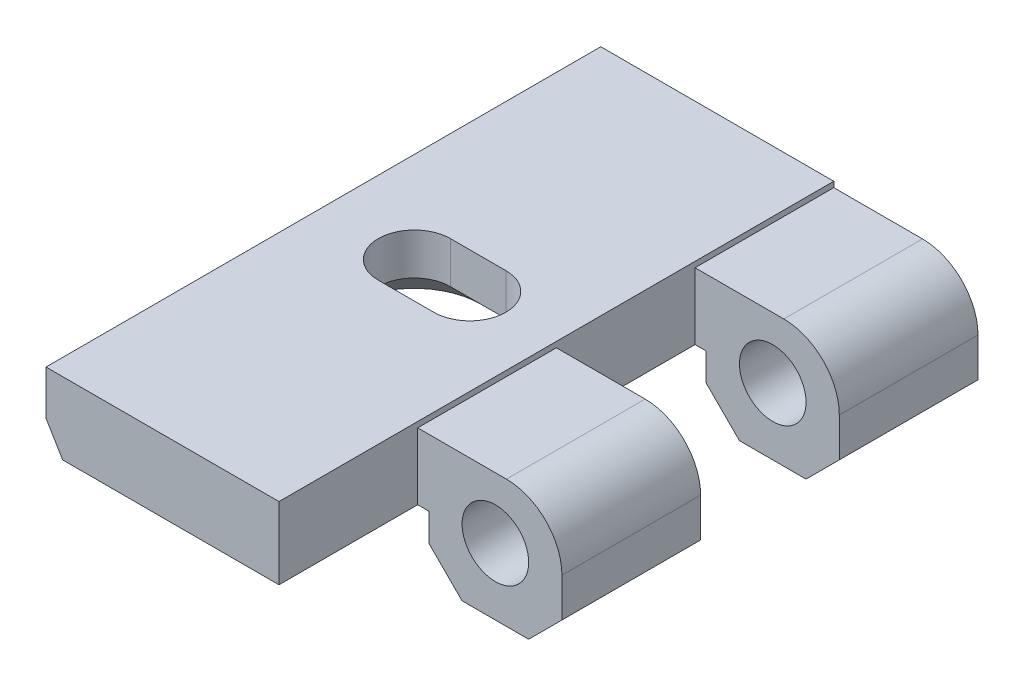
ISO-10303-21;
HEADER;
FILE_DESCRIPTION(('STEP AP214'),'2;1');
FILE_NAME('part.step','',(''),(''),'','','');
FILE_SCHEMA(('AUTOMOTIVE_DESIGN { 1 0 10303 214 1 1 1 1 }'));
ENDSEC;
DATA;
#1=APPLICATION_CONTEXT('core data for automotive mechanical design processes');
#2=APPLICATION_PROTOCOL_DEFINITION('international standard','automotive_design',2000,#1);
#3=PRODUCT_CONTEXT('',#1,'mechanical');
#4=PRODUCT('Part','Part','',(#3));
#5=PRODUCT_RELATED_PRODUCT_CATEGORY('part','',(#4));
#6=PRODUCT_DEFINITION_FORMATION('','',#4);
#7=PRODUCT_DEFINITION_CONTEXT('part definition',#1,'design');
#8=PRODUCT_DEFINITION('design','',#6,#7);
#9=PRODUCT_DEFINITION_SHAPE('','',#8);
#10=(LENGTH_UNIT() NAMED_UNIT(*) SI_UNIT(.MILLI.,.METRE.));
#11=(NAMED_UNIT(*) PLANE_ANGLE_UNIT() SI_UNIT($,.RADIAN.));
#12=(NAMED_UNIT(*) SI_UNIT($,.STERADIAN.) SOLID_ANGLE_UNIT());
#13=UNCERTAINTY_MEASURE_WITH_UNIT(LENGTH_MEASURE(1.E-05),#10,'distance_accuracy_value','');
#14=(GEOMETRIC_REPRESENTATION_CONTEXT(3) GLOBAL_UNCERTAINTY_ASSIGNED_CONTEXT((#13)) GLOBAL_UNIT_ASSIGNED_CONTEXT((#10,
#11,#12)) REPRESENTATION_CONTEXT('',''));
#15=CARTESIAN_POINT('',(0.,0.,0.));
#16=DIRECTION('',(0.,0.,1.));
#17=DIRECTION('',(1.,0.,0.));
#18=AXIS2_PLACEMENT_3D('',#15,#16,#17);
#19=CARTESIAN_POINT('',(-20.3,32.8500765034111,0.));
#20=DIRECTION('',(-0.707106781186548,-0.707106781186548,0.));
#21=DIRECTION('',(0.707106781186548,-0.707106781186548,0.));
#22=AXIS2_PLACEMENT_3D('',#19,#20,#21);
#23=PLANE('',#22);
#24=DIRECTION('',(0.707106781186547,-0.707106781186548,0.));
#25=VECTOR('',#24,1.);
#26=CARTESIAN_POINT('',(-23.3,35.8500765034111,0.));
#27=LINE('',#26,#25);
#28=CARTESIAN_POINT('',(-23.3,35.8500765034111,0.));
#29=VERTEX_POINT('',#28);
#30=CARTESIAN_POINT('',(-20.3,32.8500765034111,0.));
#31=VERTEX_POINT('',#30);
#32=EDGE_CURVE('E143',#29,#31,#27,.T.);
#33=ORIENTED_EDGE('',*,*,#32,.T.);
#34=DIRECTION('',(0.,0.,-1.));
#35=VECTOR('',#34,1.);
#36=CARTESIAN_POINT('',(-20.3,32.8500765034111,0.));
#37=LINE('',#36,#35);
#38=CARTESIAN_POINT('',(-20.3,32.8500765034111,12.5));
#39=VERTEX_POINT('',#38);
#40=EDGE_CURVE('E130',#39,#31,#37,.T.);
#41=ORIENTED_EDGE('',*,*,#40,.F.);
#42=DIRECTION('',(0.707106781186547,-0.707106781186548,0.));
#43=VECTOR('',#42,1.);
#44=CARTESIAN_POINT('',(-23.3,35.8500765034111,12.5));
#45=LINE('',#44,#43);
#46=CARTESIAN_POINT('',(-23.3,35.8500765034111,12.5));
#47=VERTEX_POINT('',#46);
#48=EDGE_CURVE('E145',#47,#39,#45,.T.);
#49=ORIENTED_EDGE('',*,*,#48,.F.);
#50=DIRECTION('',(0.,0.,1.));
#51=VECTOR('',#50,1.);
#52=CARTESIAN_POINT('',(-23.3,35.8500765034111,0.));
#53=LINE('',#52,#51);
#54=EDGE_CURVE('E138',#29,#47,#53,.T.);
#55=ORIENTED_EDGE('',*,*,#54,.F.);
#56=EDGE_LOOP('',(#33,#41,#49,#55));
#57=FACE_BOUND('',#56,.T.);
#58=ADVANCED_FACE('F16',(#57),#23,.T.);
#59=CARTESIAN_POINT('',(-14.3,32.8500765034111,0.));
#60=DIRECTION('',(0.,-1.,0.));
#61=DIRECTION('',(0.,0.,-1.));
#62=AXIS2_PLACEMENT_3D('',#59,#60,#61);
#63=PLANE('',#62);
#64=DIRECTION('',(1.,0.,0.));
#65=VECTOR('',#64,1.);
#66=CARTESIAN_POINT('',(-18.0886728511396,32.8500765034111,0.));
#67=LINE('',#66,#65);
#68=CARTESIAN_POINT('',(-14.3,32.8500765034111,0.));
#69=VERTEX_POINT('',#68);
#70=EDGE_CURVE('E164',#31,#69,#67,.T.);
#71=ORIENTED_EDGE('',*,*,#70,.T.);
#72=DIRECTION('',(0.,0.,1.));
#73=VECTOR('',#72,1.);
#74=CARTESIAN_POINT('',(-14.3,32.8500765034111,0.));
#75=LINE('',#74,#73);
#76=CARTESIAN_POINT('',(-14.3,32.8500765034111,12.5));
#77=VERTEX_POINT('',#76);
#78=EDGE_CURVE('E444',#77,#69,#75,.F.);
#79=ORIENTED_EDGE('',*,*,#78,.F.);
#80=DIRECTION('',(1.,0.,0.));
#81=VECTOR('',#80,1.);
#82=CARTESIAN_POINT('',(-18.0886728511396,32.8500765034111,12.5));
#83=LINE('',#82,#81);
#84=EDGE_CURVE('E174',#39,#77,#83,.T.);
#85=ORIENTED_EDGE('',*,*,#84,.F.);
#86=ORIENTED_EDGE('',*,*,#40,.T.);
#87=EDGE_LOOP('',(#71,#79,#85,#86));
#88=FACE_BOUND('',#87,.T.);
#89=ADVANCED_FACE('F448',(#88),#63,.T.);
#90=CARTESIAN_POINT('',(-11.3,35.8500765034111,0.));
#91=DIRECTION('',(0.707106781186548,-0.707106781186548,0.));
#92=DIRECTION('',(0.707106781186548,0.707106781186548,0.));
#93=AXIS2_PLACEMENT_3D('',#90,#91,#92);
#94=PLANE('',#93);
#95=DIRECTION('',(0.707106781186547,0.707106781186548,0.));
#96=VECTOR('',#95,1.);
#97=CARTESIAN_POINT('',(-14.3,32.8500765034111,0.));
#98=LINE('',#97,#96);
#99=CARTESIAN_POINT('',(-11.3,35.8500765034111,0.));
#100=VERTEX_POINT('',#99);
#101=EDGE_CURVE('E166',#69,#100,#98,.T.);
#102=ORIENTED_EDGE('',*,*,#101,.T.);
#103=DIRECTION('',(0.,0.,-1.));
#104=VECTOR('',#103,1.);
#105=CARTESIAN_POINT('',(-11.3,35.8500765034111,0.));
#106=LINE('',#105,#104);
#107=CARTESIAN_POINT('',(-11.3,35.8500765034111,12.5));
#108=VERTEX_POINT('',#107);
#109=EDGE_CURVE('E113',#108,#100,#106,.T.);
#110=ORIENTED_EDGE('',*,*,#109,.F.);
#111=DIRECTION('',(0.707106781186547,0.707106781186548,0.));
#112=VECTOR('',#111,1.);
#113=CARTESIAN_POINT('',(-14.3,32.8500765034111,12.5));
#114=LINE('',#113,#112);
#115=EDGE_CURVE('E170',#77,#108,#114,.T.);
#116=ORIENTED_EDGE('',*,*,#115,.F.);
#117=ORIENTED_EDGE('',*,*,#78,.T.);
#118=EDGE_LOOP('',(#102,#110,#116,#117));
#119=FACE_BOUND('',#118,.T.);
#120=ADVANCED_FACE('F538',(#119),#94,.T.);
#121=CARTESIAN_POINT('',(-11.3,39.3500765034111,0.));
#122=DIRECTION('',(1.,0.,0.));
#123=DIRECTION('',(0.,0.,-1.));
#124=AXIS2_PLACEMENT_3D('',#121,#122,#123);
#125=PLANE('',#124);
#126=DIRECTION('',(0.,1.,0.));
#127=VECTOR('',#126,1.);
#128=CARTESIAN_POINT('',(-11.3,38.9414196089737,0.));
#129=LINE('',#128,#127);
#130=CARTESIAN_POINT('',(-11.3,39.3500765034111,0.));
#131=VERTEX_POINT('',#130);
#132=EDGE_CURVE('E402',#100,#131,#129,.T.);
#133=ORIENTED_EDGE('',*,*,#132,.T.);
#134=DIRECTION('',(0.,0.,1.));
#135=VECTOR('',#134,1.);
#136=CARTESIAN_POINT('',(-11.3,39.3500765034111,0.));
#137=LINE('',#136,#135);
#138=CARTESIAN_POINT('',(-11.3,39.3500765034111,12.5));
#139=VERTEX_POINT('',#138);
#140=EDGE_CURVE('E102',#139,#131,#137,.F.);
#141=ORIENTED_EDGE('',*,*,#140,.F.);
#142=DIRECTION('',(0.,1.,0.));
#143=VECTOR('',#142,1.);
#144=CARTESIAN_POINT('',(-11.3,38.9414196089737,12.5));
#145=LINE('',#144,#143);
#146=EDGE_CURVE('E173',#108,#139,#145,.T.);
#147=ORIENTED_EDGE('',*,*,#146,.F.);
#148=ORIENTED_EDGE('',*,*,#109,.T.);
#149=EDGE_LOOP('',(#133,#141,#147,#148));
#150=FACE_BOUND('',#149,.T.);
#151=ADVANCED_FACE('F537',(#150),#125,.T.);
#152=CARTESIAN_POINT('',(-16.3,39.3500765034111,0.));
#153=DIRECTION('',(0.,0.,1.));
#154=DIRECTION('',(1.,0.,0.));
#155=AXIS2_PLACEMENT_3D('',#152,#153,#154);
#156=CYLINDRICAL_SURFACE('',#155,5.);
#157=CARTESIAN_POINT('',(-16.3,39.3500765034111,0.));
#158=DIRECTION('',(0.,0.,1.));
#159=DIRECTION('',(1.,0.,0.));
#160=AXIS2_PLACEMENT_3D('',#157,#158,#159);
#161=CIRCLE('',#160,5.);
#162=CARTESIAN_POINT('',(-16.3,44.3500765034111,0.));
#163=VERTEX_POINT('',#162);
#164=EDGE_CURVE('E401',#131,#163,#161,.T.);
#165=ORIENTED_EDGE('',*,*,#164,.T.);
#166=DIRECTION('',(0.,0.,1.));
#167=VECTOR('',#166,1.);
#168=CARTESIAN_POINT('',(-16.3,44.3500765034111,0.));
#169=LINE('',#168,#167);
#170=CARTESIAN_POINT('',(-16.3,44.3500765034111,12.5));
#171=VERTEX_POINT('',#170);
#172=EDGE_CURVE('E158',#171,#163,#169,.F.);
#173=ORIENTED_EDGE('',*,*,#172,.F.);
#174=CARTESIAN_POINT('',(-16.3,39.3500765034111,12.5));
#175=DIRECTION('',(0.,0.,1.));
#176=DIRECTION('',(1.,0.,0.));
#177=AXIS2_PLACEMENT_3D('',#174,#175,#176);
#178=CIRCLE('',#177,5.);
#179=EDGE_CURVE('E19',#139,#171,#178,.T.);
#180=ORIENTED_EDGE('',*,*,#179,.F.);
#181=ORIENTED_EDGE('',*,*,#140,.T.);
#182=EDGE_LOOP('',(#165,#173,#180,#181));
#183=FACE_BOUND('',#182,.T.);
#184=ADVANCED_FACE('F529',(#183),#156,.T.);
#185=CARTESIAN_POINT('',(-17.3,38.8500765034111,0.));
#186=DIRECTION('',(0.,0.,1.));
#187=DIRECTION('',(1.,0.,0.));
#188=AXIS2_PLACEMENT_3D('',#185,#186,#187);
#189=CYLINDRICAL_SURFACE('',#188,3.);
#190=CARTESIAN_POINT('',(-17.3,38.8500765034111,0.));
#191=DIRECTION('',(0.,0.,1.));
#192=DIRECTION('',(1.,0.,0.));
#193=AXIS2_PLACEMENT_3D('',#190,#191,#192);
#194=CIRCLE('',#193,3.);
#195=CARTESIAN_POINT('',(-14.3,38.8500765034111,0.));
#196=VERTEX_POINT('',#195);
#197=EDGE_CURVE('E393',#196,#196,#194,.F.);
#198=ORIENTED_EDGE('',*,*,#197,.T.);
#199=EDGE_LOOP('',(#198));
#200=FACE_BOUND('',#199,.T.);
#201=CARTESIAN_POINT('',(-17.3,38.8500765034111,12.5));
#202=DIRECTION('',(0.,0.,1.));
#203=DIRECTION('',(1.,0.,0.));
#204=AXIS2_PLACEMENT_3D('',#201,#202,#203);
#205=CIRCLE('',#204,3.);
#206=CARTESIAN_POINT('',(-14.3,38.8500765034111,12.5));
#207=VERTEX_POINT('',#206);
#208=EDGE_CURVE('E410',#207,#207,#205,.F.);
#209=ORIENTED_EDGE('',*,*,#208,.F.);
#210=EDGE_LOOP('',(#209));
#211=FACE_BOUND('',#210,.T.);
#212=ADVANCED_FACE('F549',(#200,#211),#189,.F.);
#213=CARTESIAN_POINT('',(-23.3,35.8500765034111,0.));
#214=DIRECTION('',(-1.,0.,0.));
#215=DIRECTION('',(0.,0.,1.));
#216=AXIS2_PLACEMENT_3D('',#213,#214,#215);
#217=PLANE('',#216);
#218=DIRECTION('',(0.,1.,0.));
#219=VECTOR('',#218,1.);
#220=CARTESIAN_POINT('',(-23.3,38.9414196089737,0.));
#221=LINE('',#220,#219);
#222=CARTESIAN_POINT('',(-23.3,38.3500765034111,0.));
#223=VERTEX_POINT('',#222);
#224=EDGE_CURVE('E151',#223,#29,#221,.F.);
#225=ORIENTED_EDGE('',*,*,#224,.T.);
#226=ORIENTED_EDGE('',*,*,#54,.T.);
#227=DIRECTION('',(0.,1.,0.));
#228=VECTOR('',#227,1.);
#229=CARTESIAN_POINT('',(-23.3,38.9414196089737,12.5));
#230=LINE('',#229,#228);
#231=CARTESIAN_POINT('',(-23.3,38.3500765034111,12.5));
#232=VERTEX_POINT('',#231);
#233=EDGE_CURVE('E147',#232,#47,#230,.F.);
#234=ORIENTED_EDGE('',*,*,#233,.F.);
#235=DIRECTION('',(0.,0.,-1.));
#236=VECTOR('',#235,1.);
#237=CARTESIAN_POINT('',(-23.3,38.3500765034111,-25.));
#238=LINE('',#237,#236);
#239=EDGE_CURVE('E154',#223,#232,#238,.F.);
#240=ORIENTED_EDGE('',*,*,#239,.F.);
#241=EDGE_LOOP('',(#225,#226,#234,#240));
#242=FACE_BOUND('',#241,.T.);
#243=ADVANCED_FACE('F152',(#242),#217,.T.);
#244=CARTESIAN_POINT('',(-18.0886728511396,38.9414196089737,12.5));
#245=DIRECTION('',(0.,0.,1.));
#246=DIRECTION('',(1.,0.,0.));
#247=AXIS2_PLACEMENT_3D('',#244,#245,#246);
#248=PLANE('',#247);
#249=ORIENTED_EDGE('',*,*,#208,.T.);
#250=EDGE_LOOP('',(#249));
#251=FACE_BOUND('',#250,.T.);
#252=ORIENTED_EDGE('',*,*,#146,.T.);
#253=ORIENTED_EDGE('',*,*,#179,.T.);
#254=DIRECTION('',(1.,0.,0.));
#255=VECTOR('',#254,1.);
#256=CARTESIAN_POINT('',(-17.3,44.3500765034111,12.5));
#257=LINE('',#256,#255);
#258=CARTESIAN_POINT('',(-24.3,44.3500765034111,12.5));
#259=VERTEX_POINT('',#258);
#260=EDGE_CURVE('E407',#259,#171,#257,.T.);
#261=ORIENTED_EDGE('',*,*,#260,.F.);
#262=DIRECTION('',(0.,1.,0.));
#263=VECTOR('',#262,1.);
#264=CARTESIAN_POINT('',(-24.3,44.8500765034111,12.5));
#265=LINE('',#264,#263);
#266=CARTESIAN_POINT('',(-24.3,38.3500765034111,12.5));
#267=VERTEX_POINT('',#266);
#268=EDGE_CURVE('E406',#267,#259,#265,.T.);
#269=ORIENTED_EDGE('',*,*,#268,.F.);
#270=DIRECTION('',(1.,0.,0.));
#271=VECTOR('',#270,1.);
#272=CARTESIAN_POINT('',(-24.3,38.3500765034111,12.5));
#273=LINE('',#272,#271);
#274=EDGE_CURVE('E416',#232,#267,#273,.F.);
#275=ORIENTED_EDGE('',*,*,#274,.F.);
#276=ORIENTED_EDGE('',*,*,#233,.T.);
#277=ORIENTED_EDGE('',*,*,#48,.T.);
#278=ORIENTED_EDGE('',*,*,#84,.T.);
#279=ORIENTED_EDGE('',*,*,#115,.T.);
#280=EDGE_LOOP('',(#252,#253,#261,#269,#275,#276,#277,#278,#279));
#281=FACE_BOUND('',#280,.T.);
#282=ADVANCED_FACE('F450',(#251,#281),#248,.T.);
#283=CARTESIAN_POINT('',(-17.3,44.3500765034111,0.));
#284=DIRECTION('',(0.,1.,0.));
#285=DIRECTION('',(0.,0.,1.));
#286=AXIS2_PLACEMENT_3D('',#283,#284,#285);
#287=PLANE('',#286);
#288=DIRECTION('',(1.,0.,0.));
#289=VECTOR('',#288,1.);
#290=CARTESIAN_POINT('',(-18.0886728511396,44.3500765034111,0.));
#291=LINE('',#290,#289);
#292=CARTESIAN_POINT('',(-24.3,44.3500765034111,0.));
#293=VERTEX_POINT('',#292);
#294=EDGE_CURVE('E398',#163,#293,#291,.F.);
#295=ORIENTED_EDGE('',*,*,#294,.T.);
#296=DIRECTION('',(0.,0.,-1.));
#297=VECTOR('',#296,1.);
#298=CARTESIAN_POINT('',(-24.3,44.3500765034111,-25.));
#299=LINE('',#298,#297);
#300=EDGE_CURVE('E397',#259,#293,#299,.T.);
#301=ORIENTED_EDGE('',*,*,#300,.F.);
#302=ORIENTED_EDGE('',*,*,#260,.T.);
#303=ORIENTED_EDGE('',*,*,#172,.T.);
#304=EDGE_LOOP('',(#295,#301,#302,#303));
#305=FACE_BOUND('',#304,.T.);
#306=ADVANCED_FACE('F526',(#305),#287,.T.);
#307=CARTESIAN_POINT('',(-18.0886728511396,38.9414196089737,0.));
#308=DIRECTION('',(0.,0.,1.));
#309=DIRECTION('',(1.,0.,0.));
#310=AXIS2_PLACEMENT_3D('',#307,#308,#309);
#311=PLANE('',#310);
#312=ORIENTED_EDGE('',*,*,#197,.F.);
#313=EDGE_LOOP('',(#312));
#314=FACE_BOUND('',#313,.T.);
#315=ORIENTED_EDGE('',*,*,#164,.F.);
#316=ORIENTED_EDGE('',*,*,#132,.F.);
#317=ORIENTED_EDGE('',*,*,#101,.F.);
#318=ORIENTED_EDGE('',*,*,#70,.F.);
#319=ORIENTED_EDGE('',*,*,#32,.F.);
#320=ORIENTED_EDGE('',*,*,#224,.F.);
#321=DIRECTION('',(1.,0.,0.));
#322=VECTOR('',#321,1.);
#323=CARTESIAN_POINT('',(-24.3,38.3500765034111,0.));
#324=LINE('',#323,#322);
#325=CARTESIAN_POINT('',(-24.3,38.3500765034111,0.));
#326=VERTEX_POINT('',#325);
#327=EDGE_CURVE('E392',#326,#223,#324,.T.);
#328=ORIENTED_EDGE('',*,*,#327,.F.);
#329=DIRECTION('',(0.,1.,0.));
#330=VECTOR('',#329,1.);
#331=CARTESIAN_POINT('',(-24.3,44.8500765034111,0.));
#332=LINE('',#331,#330);
#333=EDGE_CURVE('E388',#293,#326,#332,.F.);
#334=ORIENTED_EDGE('',*,*,#333,.F.);
#335=ORIENTED_EDGE('',*,*,#294,.F.);
#336=EDGE_LOOP('',(#315,#316,#317,#318,#319,#320,#328,#334,#335));
#337=FACE_BOUND('',#336,.T.);
#338=ADVANCED_FACE('F162',(#314,#337),#311,.F.);
#339=CARTESIAN_POINT('',(-18.0886728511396,38.9414196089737,-12.5));
#340=DIRECTION('',(0.,0.,1.));
#341=DIRECTION('',(1.,0.,0.));
#342=AXIS2_PLACEMENT_3D('',#339,#340,#341);
#343=PLANE('',#342);
#344=CARTESIAN_POINT('',(-17.3,38.8500765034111,-12.5));
#345=DIRECTION('',(0.,0.,1.));
#346=DIRECTION('',(1.,0.,0.));
#347=AXIS2_PLACEMENT_3D('',#344,#345,#346);
#348=CIRCLE('',#347,3.);
#349=CARTESIAN_POINT('',(-14.3,38.8500765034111,-12.5));
#350=VERTEX_POINT('',#349);
#351=EDGE_CURVE('E325',#350,#350,#348,.F.);
#352=ORIENTED_EDGE('',*,*,#351,.T.);
#353=EDGE_LOOP('',(#352));
#354=FACE_BOUND('',#353,.T.);
#355=DIRECTION('',(0.,1.,0.));
#356=VECTOR('',#355,1.);
#357=CARTESIAN_POINT('',(-11.3,39.3500765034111,-12.5));
#358=LINE('',#357,#356);
#359=CARTESIAN_POINT('',(-11.3,39.3500765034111,-12.5));
#360=VERTEX_POINT('',#359);
#361=CARTESIAN_POINT('',(-11.3,35.8500765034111,-12.5));
#362=VERTEX_POINT('',#361);
#363=EDGE_CURVE('E339',#360,#362,#358,.F.);
#364=ORIENTED_EDGE('',*,*,#363,.F.);
#365=CARTESIAN_POINT('',(-16.3,39.3500765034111,-12.5));
#366=DIRECTION('',(0.,0.,1.));
#367=DIRECTION('',(1.,0.,0.));
#368=AXIS2_PLACEMENT_3D('',#365,#366,#367);
#369=CIRCLE('',#368,5.);
#370=CARTESIAN_POINT('',(-16.3,44.3500765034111,-12.5));
#371=VERTEX_POINT('',#370);
#372=EDGE_CURVE('E335',#371,#360,#369,.F.);
#373=ORIENTED_EDGE('',*,*,#372,.F.);
#374=DIRECTION('',(1.,0.,0.));
#375=VECTOR('',#374,1.);
#376=CARTESIAN_POINT('',(-17.3,44.3500765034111,-12.5));
#377=LINE('',#376,#375);
#378=CARTESIAN_POINT('',(-24.3,44.3500765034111,-12.5));
#379=VERTEX_POINT('',#378);
#380=EDGE_CURVE('E326',#379,#371,#377,.T.);
#381=ORIENTED_EDGE('',*,*,#380,.F.);
#382=DIRECTION('',(0.,1.,0.));
#383=VECTOR('',#382,1.);
#384=CARTESIAN_POINT('',(-24.3,44.8500765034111,-12.5));
#385=LINE('',#384,#383);
#386=CARTESIAN_POINT('',(-24.3,38.3500765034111,-12.5));
#387=VERTEX_POINT('',#386);
#388=EDGE_CURVE('E329',#387,#379,#385,.T.);
#389=ORIENTED_EDGE('',*,*,#388,.F.);
#390=DIRECTION('',(1.,0.,0.));
#391=VECTOR('',#390,1.);
#392=CARTESIAN_POINT('',(-24.3,38.3500765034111,-12.5));
#393=LINE('',#392,#391);
#394=CARTESIAN_POINT('',(-23.3,38.3500765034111,-12.5));
#395=VERTEX_POINT('',#394);
#396=EDGE_CURVE('E389',#395,#387,#393,.F.);
#397=ORIENTED_EDGE('',*,*,#396,.F.);
#398=DIRECTION('',(0.,1.,0.));
#399=VECTOR('',#398,1.);
#400=CARTESIAN_POINT('',(-23.3,35.8500765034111,-12.5));
#401=LINE('',#400,#399);
#402=CARTESIAN_POINT('',(-23.3,35.8500765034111,-12.5));
#403=VERTEX_POINT('',#402);
#404=EDGE_CURVE('E367',#403,#395,#401,.T.);
#405=ORIENTED_EDGE('',*,*,#404,.F.);
#406=DIRECTION('',(0.707106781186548,-0.707106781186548,0.));
#407=VECTOR('',#406,1.);
#408=CARTESIAN_POINT('',(-20.3,32.8500765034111,-12.5));
#409=LINE('',#408,#407);
#410=CARTESIAN_POINT('',(-20.3,32.8500765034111,-12.5));
#411=VERTEX_POINT('',#410);
#412=EDGE_CURVE('E360',#411,#403,#409,.F.);
#413=ORIENTED_EDGE('',*,*,#412,.F.);
#414=DIRECTION('',(1.,0.,0.));
#415=VECTOR('',#414,1.);
#416=CARTESIAN_POINT('',(-14.3,32.8500765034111,-12.5));
#417=LINE('',#416,#415);
#418=CARTESIAN_POINT('',(-14.3,32.8500765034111,-12.5));
#419=VERTEX_POINT('',#418);
#420=EDGE_CURVE('E353',#419,#411,#417,.F.);
#421=ORIENTED_EDGE('',*,*,#420,.F.);
#422=DIRECTION('',(0.707106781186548,0.707106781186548,0.));
#423=VECTOR('',#422,1.);
#424=CARTESIAN_POINT('',(-11.3,35.8500765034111,-12.5));
#425=LINE('',#424,#423);
#426=EDGE_CURVE('E346',#362,#419,#425,.F.);
#427=ORIENTED_EDGE('',*,*,#426,.F.);
#428=EDGE_LOOP('',(#364,#373,#381,#389,#397,#405,#413,#421,#427));
#429=FACE_BOUND('',#428,.T.);
#430=ADVANCED_FACE('F521',(#354,#429),#343,.T.);
#431=CARTESIAN_POINT('',(-24.3,38.3500765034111,-25.));
#432=DIRECTION('',(0.,-1.,0.));
#433=DIRECTION('',(0.,0.,-1.));
#434=AXIS2_PLACEMENT_3D('',#431,#432,#433);
#435=PLANE('',#434);
#436=DIRECTION('',(1.,0.,0.));
#437=VECTOR('',#436,1.);
#438=CARTESIAN_POINT('',(-34.6,38.3500765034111,6.));
#439=LINE('',#438,#437);
#440=CARTESIAN_POINT('',(-32.1,38.3500765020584,6.00000000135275));
#441=VERTEX_POINT('',#440);
#442=CARTESIAN_POINT('',(-37.1,38.3500765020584,6.00000000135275));
#443=VERTEX_POINT('',#442);
#444=EDGE_CURVE('E306',#441,#443,#439,.F.);
#445=ORIENTED_EDGE('',*,*,#444,.F.);
#446=CARTESIAN_POINT('',(-32.1,38.3500765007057,0.));
#447=DIRECTION('',(0.,-1.,0.));
#448=DIRECTION('',(0.,0.,-1.));
#449=AXIS2_PLACEMENT_3D('',#446,#447,#448);
#450=CIRCLE('',#449,5.999999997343);
#451=CARTESIAN_POINT('',(-32.1,38.3500765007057,-5.99999999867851));
#452=VERTEX_POINT('',#451);
#453=EDGE_CURVE('E314',#441,#452,#450,.F.);
#454=ORIENTED_EDGE('',*,*,#453,.T.);
#455=DIRECTION('',(1.,0.,0.));
#456=VECTOR('',#455,1.);
#457=CARTESIAN_POINT('',(-34.6,38.3500765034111,-6.));
#458=LINE('',#457,#456);
#459=CARTESIAN_POINT('',(-37.1,38.3500765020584,-6.00000000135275));
#460=VERTEX_POINT('',#459);
#461=EDGE_CURVE('E320',#460,#452,#458,.T.);
#462=ORIENTED_EDGE('',*,*,#461,.F.);
#463=CARTESIAN_POINT('',(-37.1,38.3500765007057,0.));
#464=DIRECTION('',(0.,-1.,0.));
#465=DIRECTION('',(0.,0.,-1.));
#466=AXIS2_PLACEMENT_3D('',#463,#464,#465);
#467=CIRCLE('',#466,5.99999999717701);
#468=EDGE_CURVE('E321',#460,#443,#467,.F.);
#469=ORIENTED_EDGE('',*,*,#468,.T.);
#470=EDGE_LOOP('',(#445,#454,#462,#469));
#471=FACE_BOUND('',#470,.T.);
#472=ORIENTED_EDGE('',*,*,#274,.T.);
#473=DIRECTION('',(0.,0.,-1.));
#474=VECTOR('',#473,1.);
#475=CARTESIAN_POINT('',(-24.3,38.3500765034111,-25.));
#476=LINE('',#475,#474);
#477=CARTESIAN_POINT('',(-24.3,38.3500765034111,25.));
#478=VERTEX_POINT('',#477);
#479=EDGE_CURVE('E300',#478,#267,#476,.T.);
#480=ORIENTED_EDGE('',*,*,#479,.F.);
#481=DIRECTION('',(1.,0.,0.));
#482=VECTOR('',#481,1.);
#483=CARTESIAN_POINT('',(-34.5690995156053,38.3500765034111,25.));
#484=LINE('',#483,#482);
#485=CARTESIAN_POINT('',(-43.8,38.3500765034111,25.));
#486=VERTEX_POINT('',#485);
#487=EDGE_CURVE('E413',#486,#478,#484,.T.);
#488=ORIENTED_EDGE('',*,*,#487,.F.);
#489=DIRECTION('',(0.,0.,1.));
#490=VECTOR('',#489,1.);
#491=CARTESIAN_POINT('',(-43.8,38.3500765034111,-25.));
#492=LINE('',#491,#490);
#493=CARTESIAN_POINT('',(-43.8,38.3500765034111,-25.));
#494=VERTEX_POINT('',#493);
#495=EDGE_CURVE('E373',#494,#486,#492,.T.);
#496=ORIENTED_EDGE('',*,*,#495,.F.);
#497=DIRECTION('',(1.,0.,0.));
#498=VECTOR('',#497,1.);
#499=CARTESIAN_POINT('',(-34.5690995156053,38.3500765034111,-25.));
#500=LINE('',#499,#498);
#501=CARTESIAN_POINT('',(-23.3,38.3500765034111,-25.));
#502=VERTEX_POINT('',#501);
#503=EDGE_CURVE('E363',#494,#502,#500,.T.);
#504=ORIENTED_EDGE('',*,*,#503,.T.);
#505=DIRECTION('',(0.,0.,1.));
#506=VECTOR('',#505,1.);
#507=CARTESIAN_POINT('',(-23.3,38.3500765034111,-25.));
#508=LINE('',#507,#506);
#509=EDGE_CURVE('E364',#395,#502,#508,.F.);
#510=ORIENTED_EDGE('',*,*,#509,.F.);
#511=ORIENTED_EDGE('',*,*,#396,.T.);
#512=DIRECTION('',(0.,0.,-1.));
#513=VECTOR('',#512,1.);
#514=CARTESIAN_POINT('',(-24.3,38.3500765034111,-25.));
#515=LINE('',#514,#513);
#516=EDGE_CURVE('E385',#326,#387,#515,.T.);
#517=ORIENTED_EDGE('',*,*,#516,.F.);
#518=ORIENTED_EDGE('',*,*,#327,.T.);
#519=ORIENTED_EDGE('',*,*,#239,.T.);
#520=EDGE_LOOP('',(#472,#480,#488,#496,#504,#510,#511,#517,#518,#519));
#521=FACE_BOUND('',#520,.T.);
#522=ADVANCED_FACE('F504',(#471,#521),#435,.T.);
#523=CARTESIAN_POINT('',(-23.3,35.8500765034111,-25.));
#524=DIRECTION('',(-1.,0.,0.));
#525=DIRECTION('',(0.,0.,1.));
#526=AXIS2_PLACEMENT_3D('',#523,#524,#525);
#527=PLANE('',#526);
#528=DIRECTION('',(0.,1.,0.));
#529=VECTOR('',#528,1.);
#530=CARTESIAN_POINT('',(-23.3,41.6750836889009,-25.));
#531=LINE('',#530,#529);
#532=CARTESIAN_POINT('',(-23.3,35.8500765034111,-25.));
#533=VERTEX_POINT('',#532);
#534=EDGE_CURVE('E356',#502,#533,#531,.F.);
#535=ORIENTED_EDGE('',*,*,#534,.T.);
#536=DIRECTION('',(0.,0.,1.));
#537=VECTOR('',#536,1.);
#538=CARTESIAN_POINT('',(-23.3,35.8500765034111,-25.));
#539=LINE('',#538,#537);
#540=EDGE_CURVE('E357',#403,#533,#539,.F.);
#541=ORIENTED_EDGE('',*,*,#540,.F.);
#542=ORIENTED_EDGE('',*,*,#404,.T.);
#543=ORIENTED_EDGE('',*,*,#509,.T.);
#544=EDGE_LOOP('',(#535,#541,#542,#543));
#545=FACE_BOUND('',#544,.T.);
#546=ADVANCED_FACE('F516',(#545),#527,.T.);
#547=CARTESIAN_POINT('',(-20.3,32.8500765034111,-25.));
#548=DIRECTION('',(-0.707106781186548,-0.707106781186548,0.));
#549=DIRECTION('',(0.707106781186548,-0.707106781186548,0.));
#550=AXIS2_PLACEMENT_3D('',#547,#548,#549);
#551=PLANE('',#550);
#552=DIRECTION('',(0.707106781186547,-0.707106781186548,0.));
#553=VECTOR('',#552,1.);
#554=CARTESIAN_POINT('',(-23.3,35.8500765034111,-25.));
#555=LINE('',#554,#553);
#556=CARTESIAN_POINT('',(-20.3,32.8500765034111,-25.));
#557=VERTEX_POINT('',#556);
#558=EDGE_CURVE('E349',#533,#557,#555,.T.);
#559=ORIENTED_EDGE('',*,*,#558,.T.);
#560=DIRECTION('',(0.,0.,-1.));
#561=VECTOR('',#560,1.);
#562=CARTESIAN_POINT('',(-20.3,32.8500765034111,-25.));
#563=LINE('',#562,#561);
#564=EDGE_CURVE('E350',#411,#557,#563,.T.);
#565=ORIENTED_EDGE('',*,*,#564,.F.);
#566=ORIENTED_EDGE('',*,*,#412,.T.);
#567=ORIENTED_EDGE('',*,*,#540,.T.);
#568=EDGE_LOOP('',(#559,#565,#566,#567));
#569=FACE_BOUND('',#568,.T.);
#570=ADVANCED_FACE('F518',(#569),#551,.T.);
#571=CARTESIAN_POINT('',(-14.3,32.8500765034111,-25.));
#572=DIRECTION('',(0.,-1.,0.));
#573=DIRECTION('',(0.,0.,-1.));
#574=AXIS2_PLACEMENT_3D('',#571,#572,#573);
#575=PLANE('',#574);
#576=DIRECTION('',(1.,0.,0.));
#577=VECTOR('',#576,1.);
#578=CARTESIAN_POINT('',(-34.5690995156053,32.8500765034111,-25.));
#579=LINE('',#578,#577);
#580=CARTESIAN_POINT('',(-14.3,32.8500765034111,-25.));
#581=VERTEX_POINT('',#580);
#582=EDGE_CURVE('E342',#557,#581,#579,.T.);
#583=ORIENTED_EDGE('',*,*,#582,.T.);
#584=DIRECTION('',(0.,0.,1.));
#585=VECTOR('',#584,1.);
#586=CARTESIAN_POINT('',(-14.3,32.8500765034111,-25.));
#587=LINE('',#586,#585);
#588=EDGE_CURVE('E343',#419,#581,#587,.F.);
#589=ORIENTED_EDGE('',*,*,#588,.F.);
#590=ORIENTED_EDGE('',*,*,#420,.T.);
#591=ORIENTED_EDGE('',*,*,#564,.T.);
#592=EDGE_LOOP('',(#583,#589,#590,#591));
#593=FACE_BOUND('',#592,.T.);
#594=ADVANCED_FACE('F572',(#593),#575,.T.);
#595=CARTESIAN_POINT('',(-11.3,35.8500765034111,-25.));
#596=DIRECTION('',(0.707106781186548,-0.707106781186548,0.));
#597=DIRECTION('',(0.707106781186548,0.707106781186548,0.));
#598=AXIS2_PLACEMENT_3D('',#595,#596,#597);
#599=PLANE('',#598);
#600=DIRECTION('',(0.707106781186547,0.707106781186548,0.));
#601=VECTOR('',#600,1.);
#602=CARTESIAN_POINT('',(-14.3,32.8500765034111,-25.));
#603=LINE('',#602,#601);
#604=CARTESIAN_POINT('',(-11.3,35.8500765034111,-25.));
#605=VERTEX_POINT('',#604);
#606=EDGE_CURVE('E296',#581,#605,#603,.T.);
#607=ORIENTED_EDGE('',*,*,#606,.T.);
#608=DIRECTION('',(0.,0.,-1.));
#609=VECTOR('',#608,1.);
#610=CARTESIAN_POINT('',(-11.3,35.8500765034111,-25.));
#611=LINE('',#610,#609);
#612=EDGE_CURVE('E336',#362,#605,#611,.T.);
#613=ORIENTED_EDGE('',*,*,#612,.F.);
#614=ORIENTED_EDGE('',*,*,#426,.T.);
#615=ORIENTED_EDGE('',*,*,#588,.T.);
#616=EDGE_LOOP('',(#607,#613,#614,#615));
#617=FACE_BOUND('',#616,.T.);
#618=ADVANCED_FACE('F575',(#617),#599,.T.);
#619=CARTESIAN_POINT('',(-11.3,39.3500765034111,-25.));
#620=DIRECTION('',(1.,0.,0.));
#621=DIRECTION('',(0.,0.,-1.));
#622=AXIS2_PLACEMENT_3D('',#619,#620,#621);
#623=PLANE('',#622);
#624=DIRECTION('',(0.,1.,0.));
#625=VECTOR('',#624,1.);
#626=CARTESIAN_POINT('',(-11.3,41.6750836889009,-25.));
#627=LINE('',#626,#625);
#628=CARTESIAN_POINT('',(-11.3,39.3500765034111,-25.));
#629=VERTEX_POINT('',#628);
#630=EDGE_CURVE('E294',#605,#629,#627,.T.);
#631=ORIENTED_EDGE('',*,*,#630,.T.);
#632=DIRECTION('',(0.,0.,1.));
#633=VECTOR('',#632,1.);
#634=CARTESIAN_POINT('',(-11.3,39.3500765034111,-25.));
#635=LINE('',#634,#633);
#636=EDGE_CURVE('E332',#360,#629,#635,.F.);
#637=ORIENTED_EDGE('',*,*,#636,.F.);
#638=ORIENTED_EDGE('',*,*,#363,.T.);
#639=ORIENTED_EDGE('',*,*,#612,.T.);
#640=EDGE_LOOP('',(#631,#637,#638,#639));
#641=FACE_BOUND('',#640,.T.);
#642=ADVANCED_FACE('F579',(#641),#623,.T.);
#643=CARTESIAN_POINT('',(-16.3,39.3500765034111,-25.));
#644=DIRECTION('',(0.,0.,1.));
#645=DIRECTION('',(1.,0.,0.));
#646=AXIS2_PLACEMENT_3D('',#643,#644,#645);
#647=CYLINDRICAL_SURFACE('',#646,5.);
#648=CARTESIAN_POINT('',(-16.3,39.3500765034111,-25.));
#649=DIRECTION('',(0.,0.,1.));
#650=DIRECTION('',(1.,0.,0.));
#651=AXIS2_PLACEMENT_3D('',#648,#649,#650);
#652=CIRCLE('',#651,5.);
#653=CARTESIAN_POINT('',(-16.3,44.3500765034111,-25.));
#654=VERTEX_POINT('',#653);
#655=EDGE_CURVE('E293',#629,#654,#652,.T.);
#656=ORIENTED_EDGE('',*,*,#655,.T.);
#657=DIRECTION('',(0.,0.,1.));
#658=VECTOR('',#657,1.);
#659=CARTESIAN_POINT('',(-16.3,44.3500765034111,-25.));
#660=LINE('',#659,#658);
#661=EDGE_CURVE('E322',#371,#654,#660,.F.);
#662=ORIENTED_EDGE('',*,*,#661,.F.);
#663=ORIENTED_EDGE('',*,*,#372,.T.);
#664=ORIENTED_EDGE('',*,*,#636,.T.);
#665=EDGE_LOOP('',(#656,#662,#663,#664));
#666=FACE_BOUND('',#665,.T.);
#667=ADVANCED_FACE('F583',(#666),#647,.T.);
#668=CARTESIAN_POINT('',(-17.3,44.3500765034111,-25.));
#669=DIRECTION('',(0.,1.,0.));
#670=DIRECTION('',(0.,0.,1.));
#671=AXIS2_PLACEMENT_3D('',#668,#669,#670);
#672=PLANE('',#671);
#673=DIRECTION('',(1.,0.,0.));
#674=VECTOR('',#673,1.);
#675=CARTESIAN_POINT('',(-34.5690995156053,44.3500765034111,-25.));
#676=LINE('',#675,#674);
#677=CARTESIAN_POINT('',(-24.3,44.3500765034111,-25.));
#678=VERTEX_POINT('',#677);
#679=EDGE_CURVE('E289',#654,#678,#676,.F.);
#680=ORIENTED_EDGE('',*,*,#679,.T.);
#681=DIRECTION('',(0.,0.,-1.));
#682=VECTOR('',#681,1.);
#683=CARTESIAN_POINT('',(-24.3,44.3500765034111,-25.));
#684=LINE('',#683,#682);
#685=EDGE_CURVE('E301',#379,#678,#684,.T.);
#686=ORIENTED_EDGE('',*,*,#685,.F.);
#687=ORIENTED_EDGE('',*,*,#380,.T.);
#688=ORIENTED_EDGE('',*,*,#661,.T.);
#689=EDGE_LOOP('',(#680,#686,#687,#688));
#690=FACE_BOUND('',#689,.T.);
#691=ADVANCED_FACE('F587',(#690),#672,.T.);
#692=CARTESIAN_POINT('',(-17.3,38.8500765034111,0.));
#693=DIRECTION('',(0.,0.,1.));
#694=DIRECTION('',(1.,0.,0.));
#695=AXIS2_PLACEMENT_3D('',#692,#693,#694);
#696=CYLINDRICAL_SURFACE('',#695,3.);
#697=ORIENTED_EDGE('',*,*,#351,.F.);
#698=EDGE_LOOP('',(#697));
#699=FACE_BOUND('',#698,.T.);
#700=CARTESIAN_POINT('',(-17.3,38.8500765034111,-25.));
#701=DIRECTION('',(0.,0.,1.));
#702=DIRECTION('',(1.,0.,0.));
#703=AXIS2_PLACEMENT_3D('',#700,#701,#702);
#704=CIRCLE('',#703,3.);
#705=CARTESIAN_POINT('',(-14.3,38.8500765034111,-25.));
#706=VERTEX_POINT('',#705);
#707=EDGE_CURVE('E288',#706,#706,#704,.F.);
#708=ORIENTED_EDGE('',*,*,#707,.T.);
#709=EDGE_LOOP('',(#708));
#710=FACE_BOUND('',#709,.T.);
#711=ADVANCED_FACE('F591',(#699,#710),#696,.F.);
#712=CARTESIAN_POINT('',(-43.8,38.3500765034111,-25.));
#713=DIRECTION('',(-0.857492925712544,-0.514495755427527,0.));
#714=DIRECTION('',(0.514495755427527,-0.857492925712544,0.));
#715=AXIS2_PLACEMENT_3D('',#712,#713,#714);
#716=PLANE('',#715);
#717=DIRECTION('',(0.514495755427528,-0.857492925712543,0.));
#718=VECTOR('',#717,1.);
#719=CARTESIAN_POINT('',(-45.3,40.8500765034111,-25.));
#720=LINE('',#719,#718);
#721=CARTESIAN_POINT('',(-45.3,40.8500765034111,-25.));
#722=VERTEX_POINT('',#721);
#723=EDGE_CURVE('E370',#722,#494,#720,.T.);
#724=ORIENTED_EDGE('',*,*,#723,.T.);
#725=ORIENTED_EDGE('',*,*,#495,.T.);
#726=DIRECTION('',(0.514495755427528,-0.857492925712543,0.));
#727=VECTOR('',#726,1.);
#728=CARTESIAN_POINT('',(-45.3,40.8500765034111,25.));
#729=LINE('',#728,#727);
#730=CARTESIAN_POINT('',(-45.3,40.8500765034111,25.));
#731=VERTEX_POINT('',#730);
#732=EDGE_CURVE('E305',#731,#486,#729,.T.);
#733=ORIENTED_EDGE('',*,*,#732,.F.);
#734=DIRECTION('',(0.,0.,1.));
#735=VECTOR('',#734,1.);
#736=CARTESIAN_POINT('',(-45.3,40.8500765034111,-25.));
#737=LINE('',#736,#735);
#738=EDGE_CURVE('E376',#722,#731,#737,.T.);
#739=ORIENTED_EDGE('',*,*,#738,.F.);
#740=EDGE_LOOP('',(#724,#725,#733,#739));
#741=FACE_BOUND('',#740,.T.);
#742=ADVANCED_FACE('F510',(#741),#716,.T.);
#743=CARTESIAN_POINT('',(-37.1,38.3500765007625,0.));
#744=DIRECTION('',(0.,-1.,0.));
#745=DIRECTION('',(0.,0.,-1.));
#746=AXIS2_PLACEMENT_3D('',#743,#744,#745);
#747=CONICAL_SURFACE('',#746,5.99999999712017,0.785398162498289);
#748=CARTESIAN_POINT('',(-37.1,41.1000765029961,-3.25000000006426));
#749=CARTESIAN_POINT('',(-37.1805177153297,41.1000758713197,-3.25000117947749));
#750=CARTESIAN_POINT('',(-37.2610081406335,41.1000752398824,-3.24700793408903));
#751=CARTESIAN_POINT('',(-37.4215355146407,41.1000739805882,-3.23505970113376));
#752=CARTESIAN_POINT('',(-37.5015725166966,41.1000733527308,-3.22610543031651));
#753=CARTESIAN_POINT('',(-37.7403767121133,41.1000714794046,-3.19034926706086));
#754=CARTESIAN_POINT('',(-37.897895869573,41.1000702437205,-3.15465398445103));
#755=CARTESIAN_POINT('',(-38.2266257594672,41.1000676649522,-3.05395966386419));
#756=CARTESIAN_POINT('',(-38.3968285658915,41.1000663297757,-2.98566508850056));
#757=CARTESIAN_POINT('',(-38.7233537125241,41.1000637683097,-2.82147131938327));
#758=CARTESIAN_POINT('',(-38.8796757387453,41.1000625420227,-2.7255715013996));
#759=CARTESIAN_POINT('',(-39.1739928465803,41.1000602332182,-2.50889422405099));
#760=CARTESIAN_POINT('',(-39.311988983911,41.1000591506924,-2.38811819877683));
#761=CARTESIAN_POINT('',(-39.565758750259,41.1000571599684,-2.12510162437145));
#762=CARTESIAN_POINT('',(-39.6815303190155,41.1000562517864,-1.9828590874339));
#763=CARTESIAN_POINT('',(-39.8875463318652,41.1000546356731,-1.68095906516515));
#764=CARTESIAN_POINT('',(-39.9777913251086,41.1000539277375,-1.52130195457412));
#765=CARTESIAN_POINT('',(-40.1301917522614,41.1000527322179,-1.18911101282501));
#766=CARTESIAN_POINT('',(-40.1923485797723,41.1000522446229,-1.01657782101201));
#767=CARTESIAN_POINT('',(-40.286815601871,41.1000515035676,-0.663522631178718));
#768=CARTESIAN_POINT('',(-40.3191253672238,41.1000512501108,-0.483000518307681));
#769=CARTESIAN_POINT('',(-40.3529798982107,41.1000509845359,-0.119090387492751));
#770=CARTESIAN_POINT('',(-40.3545240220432,41.1000509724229,0.0642976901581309));
#771=CARTESIAN_POINT('',(-40.3268019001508,41.1000511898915,0.42872893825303));
#772=CARTESIAN_POINT('',(-40.2975358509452,41.1000514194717,0.609772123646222));
#773=CARTESIAN_POINT('',(-40.2090247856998,41.1000521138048,0.964374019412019));
#774=CARTESIAN_POINT('',(-40.149780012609,41.1000525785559,1.1379327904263));
#775=CARTESIAN_POINT('',(-40.0029924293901,41.100053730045,1.47264326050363));
#776=CARTESIAN_POINT('',(-39.9154491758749,41.1000544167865,1.63379476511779));
#777=CARTESIAN_POINT('',(-39.7145516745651,41.100055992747,1.9391094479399));
#778=CARTESIAN_POINT('',(-39.6011980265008,41.1000568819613,2.08327302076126));
#779=CARTESIAN_POINT('',(-39.3519106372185,41.1000588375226,2.35051122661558));
#780=CARTESIAN_POINT('',(-39.2159790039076,41.1000599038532,2.47358782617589));
#781=CARTESIAN_POINT('',(-38.9253457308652,41.100062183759,2.69519938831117));
#782=CARTESIAN_POINT('',(-38.7706401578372,41.1000633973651,2.79372919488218));
#783=CARTESIAN_POINT('',(-38.4468354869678,41.1000659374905,2.9634531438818));
#784=CARTESIAN_POINT('',(-38.2777297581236,41.1000672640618,3.03463460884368));
#785=CARTESIAN_POINT('',(-37.930053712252,41.1000699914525,3.14751796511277));
#786=CARTESIAN_POINT('',(-37.7514943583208,41.1000713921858,3.1892532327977));
#787=CARTESIAN_POINT('',(-37.49287661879,41.1000734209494,3.22713726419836));
#788=CARTESIAN_POINT('',(-37.4144717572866,41.1000740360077,3.23571445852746));
#789=CARTESIAN_POINT('',(-37.2573896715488,41.1000752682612,3.2471394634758));
#790=CARTESIAN_POINT('',(-37.1787132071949,41.1000758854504,3.24999771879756));
#791=CARTESIAN_POINT('',(-37.0999999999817,41.100076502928,3.24999999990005));
#792=B_SPLINE_CURVE_WITH_KNOTS('',3,(#748,#749,#750,#751,#752,#753,#754,#755,#756,#757,#758,
#759,#760,#761,#762,#763,#764,#765,#766,#767,#768,#769,#770,#771,#772,#773,#774,#775,#776,#777,
#778,#779,#780,#781,#782,#783,#784,#785,#786,#787,#788,#789,#790,#791),.UNSPECIFIED.,.F.,.F.,(4,
2,2,2,2,2,2,2,2,2,2,2,2,2,2,2,2,2,2,2,2,4),(0.,0.24144320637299,0.48285738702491,
0.965511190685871,1.51307994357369,2.06066107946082,2.60821065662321,3.1558109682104,
3.70339949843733,4.25096085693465,4.79853008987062,5.34611074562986,5.89368790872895,
6.44126063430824,6.98884193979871,7.53641052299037,8.08392801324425,8.6315604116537,
9.1794463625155,9.72671029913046,9.96315695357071,10.1991713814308),.UNSPECIFIED.);
#793=CARTESIAN_POINT('',(-37.1,41.1000765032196,-3.24999999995));
#794=VERTEX_POINT('',#793);
#795=CARTESIAN_POINT('',(-37.1,41.1000765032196,3.2499999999));
#796=VERTEX_POINT('',#795);
#797=EDGE_CURVE('E194',#794,#796,#792,.T.);
#798=ORIENTED_EDGE('',*,*,#797,.T.);
#799=DIRECTION('',(0.,0.707106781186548,-0.707106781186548));
#800=VECTOR('',#799,1.);
#801=CARTESIAN_POINT('',(-37.1,39.7642900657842,4.58578643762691));
#802=LINE('',#801,#800);
#803=EDGE_CURVE('E302',#443,#796,#802,.T.);
#804=ORIENTED_EDGE('',*,*,#803,.F.);
#805=ORIENTED_EDGE('',*,*,#468,.F.);
#806=DIRECTION('',(0.,-0.707106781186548,-0.707106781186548));
#807=VECTOR('',#806,1.);
#808=CARTESIAN_POINT('',(-37.1,39.7642900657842,-4.58578643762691));
#809=LINE('',#808,#807);
#810=EDGE_CURVE('E317',#794,#460,#809,.T.);
#811=ORIENTED_EDGE('',*,*,#810,.F.);
#812=EDGE_LOOP('',(#798,#804,#805,#811));
#813=FACE_BOUND('',#812,.T.);
#814=ADVANCED_FACE('F597',(#813),#747,.F.);
#815=CARTESIAN_POINT('',(-34.6,39.7642900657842,-4.58578643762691));
#816=DIRECTION('',(0.,-0.707106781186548,0.707106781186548));
#817=DIRECTION('',(0.,-0.707106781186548,-0.707106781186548));
#818=AXIS2_PLACEMENT_3D('',#815,#816,#817);
#819=PLANE('',#818);
#820=ORIENTED_EDGE('',*,*,#461,.T.);
#821=DIRECTION('',(0.,0.707106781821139,0.707106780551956));
#822=VECTOR('',#821,1.);
#823=CARTESIAN_POINT('',(-32.1000000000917,-498987.750819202,-499032.1));
#824=LINE('',#823,#822);
#825=CARTESIAN_POINT('',(-32.1,41.100076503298,-3.24999999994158));
#826=VERTEX_POINT('',#825);
#827=EDGE_CURVE('E312',#452,#826,#824,.T.);
#828=ORIENTED_EDGE('',*,*,#827,.T.);
#829=DIRECTION('',(-1.,0.,0.));
#830=VECTOR('',#829,1.);
#831=CARTESIAN_POINT('',(-34.6,41.1000765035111,-3.25));
#832=LINE('',#831,#830);
#833=EDGE_CURVE('E281',#826,#794,#832,.T.);
#834=ORIENTED_EDGE('',*,*,#833,.T.);
#835=ORIENTED_EDGE('',*,*,#810,.T.);
#836=EDGE_LOOP('',(#820,#828,#834,#835));
#837=FACE_BOUND('',#836,.T.);
#838=ADVANCED_FACE('F242',(#837),#819,.T.);
#839=CARTESIAN_POINT('',(-32.1,38.3500765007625,0.));
#840=DIRECTION('',(0.,-1.,0.));
#841=DIRECTION('',(0.,0.,-1.));
#842=AXIS2_PLACEMENT_3D('',#839,#840,#841);
#843=CONICAL_SURFACE('',#842,5.99999999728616,0.785398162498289);
#844=ORIENTED_EDGE('',*,*,#453,.F.);
#845=DIRECTION('',(0.,0.707106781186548,-0.707106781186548));
#846=VECTOR('',#845,1.);
#847=CARTESIAN_POINT('',(-32.1,39.7642900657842,4.58578643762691));
#848=LINE('',#847,#846);
#849=CARTESIAN_POINT('',(-32.1,41.1000765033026,3.2499999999));
#850=VERTEX_POINT('',#849);
#851=EDGE_CURVE('E309',#850,#441,#848,.F.);
#852=ORIENTED_EDGE('',*,*,#851,.F.);
#853=CARTESIAN_POINT('',(-32.1,41.1000765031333,3.24999999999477));
#854=CARTESIAN_POINT('',(-32.0194822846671,41.1000758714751,3.25000117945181));
#855=CARTESIAN_POINT('',(-31.9389918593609,41.1000752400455,3.24700793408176));
#856=CARTESIAN_POINT('',(-31.7784644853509,41.1000739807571,3.23505970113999));
#857=CARTESIAN_POINT('',(-31.6984274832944,41.1000733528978,3.22610543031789));
#858=CARTESIAN_POINT('',(-31.4596232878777,41.1000714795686,3.1903492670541));
#859=CARTESIAN_POINT('',(-31.3021041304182,41.1000702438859,3.15465398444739));
#860=CARTESIAN_POINT('',(-30.9733742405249,41.1000676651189,3.05395966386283));
#861=CARTESIAN_POINT('',(-30.8031714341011,41.1000663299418,2.98566508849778));
#862=CARTESIAN_POINT('',(-30.476646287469,41.1000637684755,2.82147131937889));
#863=CARTESIAN_POINT('',(-30.3203242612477,41.1000625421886,2.72557150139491));
#864=CARTESIAN_POINT('',(-30.0260071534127,41.1000602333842,2.50889422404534));
#865=CARTESIAN_POINT('',(-29.8880110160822,41.1000591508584,2.38811819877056));
#866=CARTESIAN_POINT('',(-29.634241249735,41.1000571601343,2.12510162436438));
#867=CARTESIAN_POINT('',(-29.518469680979,41.1000562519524,1.98285908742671));
#868=CARTESIAN_POINT('',(-29.3124536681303,41.1000546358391,1.68095906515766));
#869=CARTESIAN_POINT('',(-29.2222086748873,41.1000539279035,1.52130195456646));
#870=CARTESIAN_POINT('',(-29.0698082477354,41.1000527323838,1.18911101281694));
#871=CARTESIAN_POINT('',(-29.0076514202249,41.1000522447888,1.0165778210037));
#872=CARTESIAN_POINT('',(-28.9131843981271,41.1000515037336,0.663522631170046));
#873=CARTESIAN_POINT('',(-28.8808746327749,41.1000512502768,0.483000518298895));
#874=CARTESIAN_POINT('',(-28.8470201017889,41.1000509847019,0.119090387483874));
#875=CARTESIAN_POINT('',(-28.8454759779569,41.1000509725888,-0.0642976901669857));
#876=CARTESIAN_POINT('',(-28.8731980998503,41.1000511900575,-0.428728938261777));
#877=CARTESIAN_POINT('',(-28.9024641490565,41.1000514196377,-0.609772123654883));
#878=CARTESIAN_POINT('',(-28.9909752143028,41.1000521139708,-0.96437401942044));
#879=CARTESIAN_POINT('',(-29.0502199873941,41.1000525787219,-1.13793279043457));
#880=CARTESIAN_POINT('',(-29.1970075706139,41.100053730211,-1.4726432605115));
#881=CARTESIAN_POINT('',(-29.2845508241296,41.1000544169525,-1.63379476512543));
#882=CARTESIAN_POINT('',(-29.4854483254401,41.100055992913,-1.93910944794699));
#883=CARTESIAN_POINT('',(-29.5988019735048,41.1000568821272,-2.08327302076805));
#884=CARTESIAN_POINT('',(-29.8480893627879,41.1000588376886,-2.35051122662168));
#885=CARTESIAN_POINT('',(-29.9840209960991,41.1000599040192,-2.47358782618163));
#886=CARTESIAN_POINT('',(-30.2746542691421,41.100062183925,-2.69519938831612));
#887=CARTESIAN_POINT('',(-30.4293598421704,41.100063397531,-2.79372919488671));
#888=CARTESIAN_POINT('',(-30.7531645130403,41.1000659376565,-2.96345314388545));
#889=CARTESIAN_POINT('',(-30.9222702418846,41.1000672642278,-3.03463460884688));
#890=CARTESIAN_POINT('',(-31.2699462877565,41.1000699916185,-3.14751796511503));
#891=CARTESIAN_POINT('',(-31.4485056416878,41.1000713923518,-3.18925323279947));
#892=CARTESIAN_POINT('',(-31.7071233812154,41.1000734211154,-3.22713726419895));
#893=CARTESIAN_POINT('',(-31.7855282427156,41.1000740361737,-3.23571445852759));
#894=CARTESIAN_POINT('',(-31.9426103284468,41.1000752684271,-3.24713946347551));
#895=CARTESIAN_POINT('',(-32.0212867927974,41.1000758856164,-3.24999771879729));
#896=CARTESIAN_POINT('',(-32.1000000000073,41.100076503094,-3.24999999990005));
#897=B_SPLINE_CURVE_WITH_KNOTS('',3,(#853,#854,#855,#856,#857,#858,#859,#860,#861,#862,#863,
#864,#865,#866,#867,#868,#869,#870,#871,#872,#873,#874,#875,#876,#877,#878,#879,#880,#881,#882,
#883,#884,#885,#886,#887,#888,#889,#890,#891,#892,#893,#894,#895,#896),.UNSPECIFIED.,.F.,.F.,(4,
2,2,2,2,2,2,2,2,2,2,2,2,2,2,2,2,2,2,2,2,4),(0.,0.241443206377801,0.482857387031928,
0.965511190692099,1.51307994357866,2.06066107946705,2.60821065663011,3.15581096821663,
3.70339949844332,4.25096085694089,4.79853008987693,5.34611074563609,5.89368790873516,
6.44126063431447,6.98884193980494,7.5364105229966,8.08392801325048,8.63156041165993,
9.17944636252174,9.72671029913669,9.96315695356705,10.1991713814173),.UNSPECIFIED.);
#898=EDGE_CURVE('E185',#850,#826,#897,.T.);
#899=ORIENTED_EDGE('',*,*,#898,.T.);
#900=ORIENTED_EDGE('',*,*,#827,.F.);
#901=EDGE_LOOP('',(#844,#852,#899,#900));
#902=FACE_BOUND('',#901,.T.);
#903=ADVANCED_FACE('F201',(#902),#843,.F.);
#904=CARTESIAN_POINT('',(-34.6,39.7642900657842,4.58578643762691));
#905=DIRECTION('',(0.,-0.707106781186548,-0.707106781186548));
#906=DIRECTION('',(0.,0.707106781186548,-0.707106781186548));
#907=AXIS2_PLACEMENT_3D('',#904,#905,#906);
#908=PLANE('',#907);
#909=ORIENTED_EDGE('',*,*,#444,.T.);
#910=ORIENTED_EDGE('',*,*,#803,.T.);
#911=DIRECTION('',(1.,0.,0.));
#912=VECTOR('',#911,1.);
#913=CARTESIAN_POINT('',(-37.1,41.1000765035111,3.2499999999));
#914=LINE('',#913,#912);
#915=EDGE_CURVE('E275',#796,#850,#914,.T.);
#916=ORIENTED_EDGE('',*,*,#915,.T.);
#917=ORIENTED_EDGE('',*,*,#851,.T.);
#918=EDGE_LOOP('',(#909,#910,#916,#917));
#919=FACE_BOUND('',#918,.T.);
#920=ADVANCED_FACE('F234',(#919),#908,.T.);
#921=CARTESIAN_POINT('',(-34.5690995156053,41.6750836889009,25.));
#922=DIRECTION('',(0.,0.,1.));
#923=DIRECTION('',(1.,0.,0.));
#924=AXIS2_PLACEMENT_3D('',#921,#922,#923);
#925=PLANE('',#924);
#926=ORIENTED_EDGE('',*,*,#732,.T.);
#927=ORIENTED_EDGE('',*,*,#487,.T.);
#928=DIRECTION('',(0.,1.,0.));
#929=VECTOR('',#928,1.);
#930=CARTESIAN_POINT('',(-24.3,44.8500765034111,25.));
#931=LINE('',#930,#929);
#932=CARTESIAN_POINT('',(-24.3,44.8500765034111,25.));
#933=VERTEX_POINT('',#932);
#934=EDGE_CURVE('E297',#933,#478,#931,.F.);
#935=ORIENTED_EDGE('',*,*,#934,.F.);
#936=DIRECTION('',(1.,0.,0.));
#937=VECTOR('',#936,1.);
#938=CARTESIAN_POINT('',(-45.3,44.8500765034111,25.));
#939=LINE('',#938,#937);
#940=CARTESIAN_POINT('',(-45.3,44.8500765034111,25.));
#941=VERTEX_POINT('',#940);
#942=EDGE_CURVE('E270',#941,#933,#939,.T.);
#943=ORIENTED_EDGE('',*,*,#942,.F.);
#944=DIRECTION('',(0.,1.,0.));
#945=VECTOR('',#944,1.);
#946=CARTESIAN_POINT('',(-45.3,40.8500765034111,25.));
#947=LINE('',#946,#945);
#948=EDGE_CURVE('E284',#731,#941,#947,.T.);
#949=ORIENTED_EDGE('',*,*,#948,.F.);
#950=EDGE_LOOP('',(#926,#927,#935,#943,#949));
#951=FACE_BOUND('',#950,.T.);
#952=ADVANCED_FACE('F231',(#951),#925,.T.);
#953=CARTESIAN_POINT('',(-24.3,44.8500765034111,-25.));
#954=DIRECTION('',(1.,0.,0.));
#955=DIRECTION('',(0.,0.,-1.));
#956=AXIS2_PLACEMENT_3D('',#953,#954,#955);
#957=PLANE('',#956);
#958=ORIENTED_EDGE('',*,*,#934,.T.);
#959=ORIENTED_EDGE('',*,*,#479,.T.);
#960=ORIENTED_EDGE('',*,*,#268,.T.);
#961=ORIENTED_EDGE('',*,*,#300,.T.);
#962=ORIENTED_EDGE('',*,*,#333,.T.);
#963=ORIENTED_EDGE('',*,*,#516,.T.);
#964=ORIENTED_EDGE('',*,*,#388,.T.);
#965=ORIENTED_EDGE('',*,*,#685,.T.);
#966=DIRECTION('',(0.,1.,0.));
#967=VECTOR('',#966,1.);
#968=CARTESIAN_POINT('',(-24.3,41.6750836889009,-25.));
#969=LINE('',#968,#967);
#970=CARTESIAN_POINT('',(-24.3,44.8500765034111,-25.));
#971=VERTEX_POINT('',#970);
#972=EDGE_CURVE('E292',#678,#971,#969,.T.);
#973=ORIENTED_EDGE('',*,*,#972,.T.);
#974=DIRECTION('',(0.,0.,1.));
#975=VECTOR('',#974,1.);
#976=CARTESIAN_POINT('',(-24.3,44.8500765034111,-25.));
#977=LINE('',#976,#975);
#978=EDGE_CURVE('E263',#933,#971,#977,.F.);
#979=ORIENTED_EDGE('',*,*,#978,.F.);
#980=EDGE_LOOP('',(#958,#959,#960,#961,#962,#963,#964,#965,#973,#979));
#981=FACE_BOUND('',#980,.T.);
#982=ADVANCED_FACE('F227',(#981),#957,.T.);
#983=CARTESIAN_POINT('',(-34.5690995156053,41.6750836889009,-25.));
#984=DIRECTION('',(0.,0.,1.));
#985=DIRECTION('',(1.,0.,0.));
#986=AXIS2_PLACEMENT_3D('',#983,#984,#985);
#987=PLANE('',#986);
#988=ORIENTED_EDGE('',*,*,#707,.F.);
#989=EDGE_LOOP('',(#988));
#990=FACE_BOUND('',#989,.T.);
#991=ORIENTED_EDGE('',*,*,#972,.F.);
#992=ORIENTED_EDGE('',*,*,#679,.F.);
#993=ORIENTED_EDGE('',*,*,#655,.F.);
#994=ORIENTED_EDGE('',*,*,#630,.F.);
#995=ORIENTED_EDGE('',*,*,#606,.F.);
#996=ORIENTED_EDGE('',*,*,#582,.F.);
#997=ORIENTED_EDGE('',*,*,#558,.F.);
#998=ORIENTED_EDGE('',*,*,#534,.F.);
#999=ORIENTED_EDGE('',*,*,#503,.F.);
#1000=ORIENTED_EDGE('',*,*,#723,.F.);
#1001=DIRECTION('',(0.,1.,0.));
#1002=VECTOR('',#1001,1.);
#1003=CARTESIAN_POINT('',(-45.3,40.8500765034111,-25.));
#1004=LINE('',#1003,#1002);
#1005=CARTESIAN_POINT('',(-45.3,44.8500765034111,-25.));
#1006=VERTEX_POINT('',#1005);
#1007=EDGE_CURVE('E287',#1006,#722,#1004,.F.);
#1008=ORIENTED_EDGE('',*,*,#1007,.F.);
#1009=DIRECTION('',(1.,0.,0.));
#1010=VECTOR('',#1009,1.);
#1011=CARTESIAN_POINT('',(-45.3,44.8500765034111,-25.));
#1012=LINE('',#1011,#1010);
#1013=EDGE_CURVE('E258',#971,#1006,#1012,.F.);
#1014=ORIENTED_EDGE('',*,*,#1013,.F.);
#1015=EDGE_LOOP('',(#991,#992,#993,#994,#995,#996,#997,#998,#999,#1000,#1008,#1014));
#1016=FACE_BOUND('',#1015,.T.);
#1017=ADVANCED_FACE('F223',(#990,#1016),#987,.F.);
#1018=CARTESIAN_POINT('',(-45.3,40.8500765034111,-25.));
#1019=DIRECTION('',(-1.,0.,0.));
#1020=DIRECTION('',(0.,0.,1.));
#1021=AXIS2_PLACEMENT_3D('',#1018,#1019,#1020);
#1022=PLANE('',#1021);
#1023=ORIENTED_EDGE('',*,*,#1007,.T.);
#1024=ORIENTED_EDGE('',*,*,#738,.T.);
#1025=ORIENTED_EDGE('',*,*,#948,.T.);
#1026=DIRECTION('',(0.,0.,1.));
#1027=VECTOR('',#1026,1.);
#1028=CARTESIAN_POINT('',(-45.3,44.8500765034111,-25.));
#1029=LINE('',#1028,#1027);
#1030=EDGE_CURVE('E184',#1006,#941,#1029,.T.);
#1031=ORIENTED_EDGE('',*,*,#1030,.F.);
#1032=EDGE_LOOP('',(#1023,#1024,#1025,#1031));
#1033=FACE_BOUND('',#1032,.T.);
#1034=ADVANCED_FACE('F219',(#1033),#1022,.T.);
#1035=CARTESIAN_POINT('',(-37.100025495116,44.8500765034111,0.));
#1036=DIRECTION('',(0.,-1.,0.));
#1037=DIRECTION('',(0.,0.,-1.));
#1038=AXIS2_PLACEMENT_3D('',#1035,#1036,#1037);
#1039=CYLINDRICAL_SURFACE('',#1038,3.25);
#1040=DIRECTION('',(0.,1.,0.));
#1041=VECTOR('',#1040,1.);
#1042=CARTESIAN_POINT('',(-37.1,44.8500765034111,-3.25));
#1043=LINE('',#1042,#1041);
#1044=CARTESIAN_POINT('',(-37.1,44.8500765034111,-3.25));
#1045=VERTEX_POINT('',#1044);
#1046=EDGE_CURVE('E282',#794,#1045,#1043,.T.);
#1047=ORIENTED_EDGE('',*,*,#1046,.T.);
#1048=CARTESIAN_POINT('',(-37.100025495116,44.8500765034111,0.));
#1049=DIRECTION('',(0.,-1.,0.));
#1050=DIRECTION('',(0.,0.,-1.));
#1051=AXIS2_PLACEMENT_3D('',#1048,#1049,#1050);
#1052=CIRCLE('',#1051,3.25);
#1053=CARTESIAN_POINT('',(-37.1,44.8500765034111,3.249999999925));
#1054=VERTEX_POINT('',#1053);
#1055=EDGE_CURVE('E181',#1054,#1045,#1052,.T.);
#1056=ORIENTED_EDGE('',*,*,#1055,.F.);
#1057=DIRECTION('',(0.,1.,0.));
#1058=VECTOR('',#1057,1.);
#1059=CARTESIAN_POINT('',(-37.1,44.8500765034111,3.2499999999));
#1060=LINE('',#1059,#1058);
#1061=EDGE_CURVE('E277',#1054,#796,#1060,.F.);
#1062=ORIENTED_EDGE('',*,*,#1061,.T.);
#1063=ORIENTED_EDGE('',*,*,#797,.F.);
#1064=EDGE_LOOP('',(#1047,#1056,#1062,#1063));
#1065=FACE_BOUND('',#1064,.T.);
#1066=ADVANCED_FACE('F214',(#1065),#1039,.F.);
#1067=CARTESIAN_POINT('',(-34.6,44.8500765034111,-3.25));
#1068=DIRECTION('',(0.,0.,-1.));
#1069=DIRECTION('',(-1.,0.,0.));
#1070=AXIS2_PLACEMENT_3D('',#1067,#1068,#1069);
#1071=PLANE('',#1070);
#1072=DIRECTION('',(0.,-1.,0.));
#1073=VECTOR('',#1072,1.);
#1074=CARTESIAN_POINT('',(-32.1,44.8500765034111,-3.2499999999));
#1075=LINE('',#1074,#1073);
#1076=CARTESIAN_POINT('',(-32.1,44.8500765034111,-3.249999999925));
#1077=VERTEX_POINT('',#1076);
#1078=EDGE_CURVE('E193',#826,#1077,#1075,.F.);
#1079=ORIENTED_EDGE('',*,*,#1078,.T.);
#1080=DIRECTION('',(1.,0.,0.));
#1081=VECTOR('',#1080,1.);
#1082=CARTESIAN_POINT('',(-45.3,44.8500765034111,-3.25));
#1083=LINE('',#1082,#1081);
#1084=EDGE_CURVE('E180',#1045,#1077,#1083,.T.);
#1085=ORIENTED_EDGE('',*,*,#1084,.F.);
#1086=ORIENTED_EDGE('',*,*,#1046,.F.);
#1087=ORIENTED_EDGE('',*,*,#833,.F.);
#1088=EDGE_LOOP('',(#1079,#1085,#1086,#1087));
#1089=FACE_BOUND('',#1088,.T.);
#1090=ADVANCED_FACE('F211',(#1089),#1071,.F.);
#1091=CARTESIAN_POINT('',(-32.099974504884,44.8500765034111,0.));
#1092=DIRECTION('',(0.,-1.,0.));
#1093=DIRECTION('',(0.,0.,-1.));
#1094=AXIS2_PLACEMENT_3D('',#1091,#1092,#1093);
#1095=CYLINDRICAL_SURFACE('',#1094,3.25);
#1096=DIRECTION('',(0.,1.,0.));
#1097=VECTOR('',#1096,1.);
#1098=CARTESIAN_POINT('',(-32.1,44.8500765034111,3.2499999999));
#1099=LINE('',#1098,#1097);
#1100=CARTESIAN_POINT('',(-32.1,44.8500765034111,3.24999999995));
#1101=VERTEX_POINT('',#1100);
#1102=EDGE_CURVE('E34',#850,#1101,#1099,.T.);
#1103=ORIENTED_EDGE('',*,*,#1102,.T.);
#1104=CARTESIAN_POINT('',(-32.099974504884,44.8500765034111,0.));
#1105=DIRECTION('',(0.,-1.,0.));
#1106=DIRECTION('',(0.,0.,-1.));
#1107=AXIS2_PLACEMENT_3D('',#1104,#1105,#1106);
#1108=CIRCLE('',#1107,3.25);
#1109=EDGE_CURVE('E25',#1077,#1101,#1108,.T.);
#1110=ORIENTED_EDGE('',*,*,#1109,.F.);
#1111=ORIENTED_EDGE('',*,*,#1078,.F.);
#1112=ORIENTED_EDGE('',*,*,#898,.F.);
#1113=EDGE_LOOP('',(#1103,#1110,#1111,#1112));
#1114=FACE_BOUND('',#1113,.T.);
#1115=ADVANCED_FACE('F205',(#1114),#1095,.F.);
#1116=CARTESIAN_POINT('',(-37.1,44.8500765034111,3.2499999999));
#1117=DIRECTION('',(0.,0.,1.));
#1118=DIRECTION('',(1.,0.,0.));
#1119=AXIS2_PLACEMENT_3D('',#1116,#1117,#1118);
#1120=PLANE('',#1119);
#1121=ORIENTED_EDGE('',*,*,#1061,.F.);
#1122=DIRECTION('',(1.,0.,0.));
#1123=VECTOR('',#1122,1.);
#1124=CARTESIAN_POINT('',(-45.3,44.8500765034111,3.25));
#1125=LINE('',#1124,#1123);
#1126=EDGE_CURVE('E11',#1101,#1054,#1125,.F.);
#1127=ORIENTED_EDGE('',*,*,#1126,.F.);
#1128=ORIENTED_EDGE('',*,*,#1102,.F.);
#1129=ORIENTED_EDGE('',*,*,#915,.F.);
#1130=EDGE_LOOP('',(#1121,#1127,#1128,#1129));
#1131=FACE_BOUND('',#1130,.T.);
#1132=ADVANCED_FACE('F210',(#1131),#1120,.F.);
#1133=CARTESIAN_POINT('',(-45.3,44.8500765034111,-25.));
#1134=DIRECTION('',(0.,1.,0.));
#1135=DIRECTION('',(0.,0.,1.));
#1136=AXIS2_PLACEMENT_3D('',#1133,#1134,#1135);
#1137=PLANE('',#1136);
#1138=ORIENTED_EDGE('',*,*,#1109,.T.);
#1139=ORIENTED_EDGE('',*,*,#1126,.T.);
#1140=ORIENTED_EDGE('',*,*,#1055,.T.);
#1141=ORIENTED_EDGE('',*,*,#1084,.T.);
#1142=EDGE_LOOP('',(#1138,#1139,#1140,#1141));
#1143=FACE_BOUND('',#1142,.T.);
#1144=ORIENTED_EDGE('',*,*,#1013,.T.);
#1145=ORIENTED_EDGE('',*,*,#1030,.T.);
#1146=ORIENTED_EDGE('',*,*,#942,.T.);
#1147=ORIENTED_EDGE('',*,*,#978,.T.);
#1148=EDGE_LOOP('',(#1144,#1145,#1146,#1147));
#1149=FACE_BOUND('',#1148,.T.);
#1150=ADVANCED_FACE('F245',(#1143,#1149),#1137,.T.);
#1151=CLOSED_SHELL('',(#58,#89,#120,#151,#184,#212,#243,#282,#306,#338,#430,#522,#546,#570,#594,
#618,#642,#667,#691,#711,#742,#814,#838,#903,#920,#952,#982,#1017,#1034,#1066,#1090,#1115,#1132,#1150));
#1152=MANIFOLD_SOLID_BREP('B1',#1151);
#1153=ADVANCED_BREP_SHAPE_REPRESENTATION('',(#18,#1152),#14);
#1154=SHAPE_DEFINITION_REPRESENTATION(#9,#1153);
ENDSEC;
END-ISO-10303-21;
